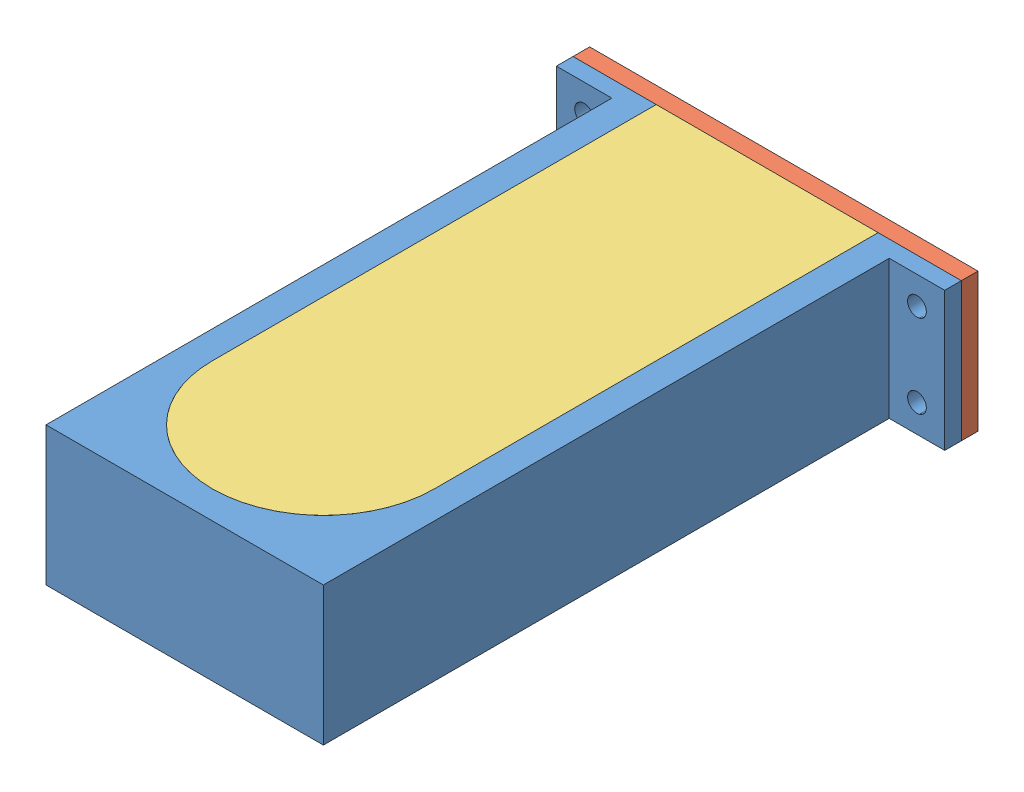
SolidWorks assembly mold_assy.SLDASM, configuration Default (file format 12000). Lengths in mm.
Overall size (70 25 108).
3 component instances, 3 part files, 6 mates.
Components (placement in the parent):
- mold_base-1: mold_base.SLDPRT [Default] at (-39.5137 -9.4121 -36.9392) size (70 25 105)
- mold_core-1: mold_core.SLDPRT [Default] at (-14.5137 15.5879 -36.9392) x (0 0 1) z (1 0 0) size (99.58 25 70)
- finger-1: finger.SLDPRT [Default] at (-14.5137 15.5879 63.0608) x (1 0 0) z (0 0 -1) size (40 20 100)
Mates (geometry in assembly coordinates):
- Concentric1: concentric aligned: cylinder of mold_base-1 through (-44.5137 10.5879 68.0608) axis (0 0 -1) radius 1.7; cylinder of mold_core-1 through (-44.5137 10.5879 59.6445) axis (0 0 -1) radius 1.7
- Coincident1: coincident anti-aligned: plane of mold_base-1 through (-39.5137 -9.4121 -36.9392) normal (0 0 -1); plane of mold_core-1 through (-14.5137 15.5879 -36.9392) normal (0 0 1)
- Concentric2: concentric aligned: cylinder of mold_base-1 through (15.4863 10.5879 68.0608) axis (0 0 -1) radius 1.7; cylinder of mold_core-1 through (15.4863 10.5879 59.6445) axis (0 0 -1) radius 1.7
- Coincident2: coincident anti-aligned: plane of mold_core-1 through (-14.5137 15.5879 -36.9392) normal (0 0 1); plane of finger-1 through (-14.5137 15.5879 -36.9392) normal (0 0 -1)
- Concentric3: concentric anti-aligned: cylinder of mold_base-1 through (-14.5137 15.5879 112.7822) axis (0 0 -1) radius 20; cylinder of finger-1 through (-14.5137 15.5879 -36.9392) axis (0 0 1) radius 20
- Coincident3: coincident aligned: plane of mold_base-1 through (-39.5137 15.5879 68.0608) normal (0 1 0); plane of finger-1 through (-34.5137 15.5879 -36.9392) normal (0 1 0)
